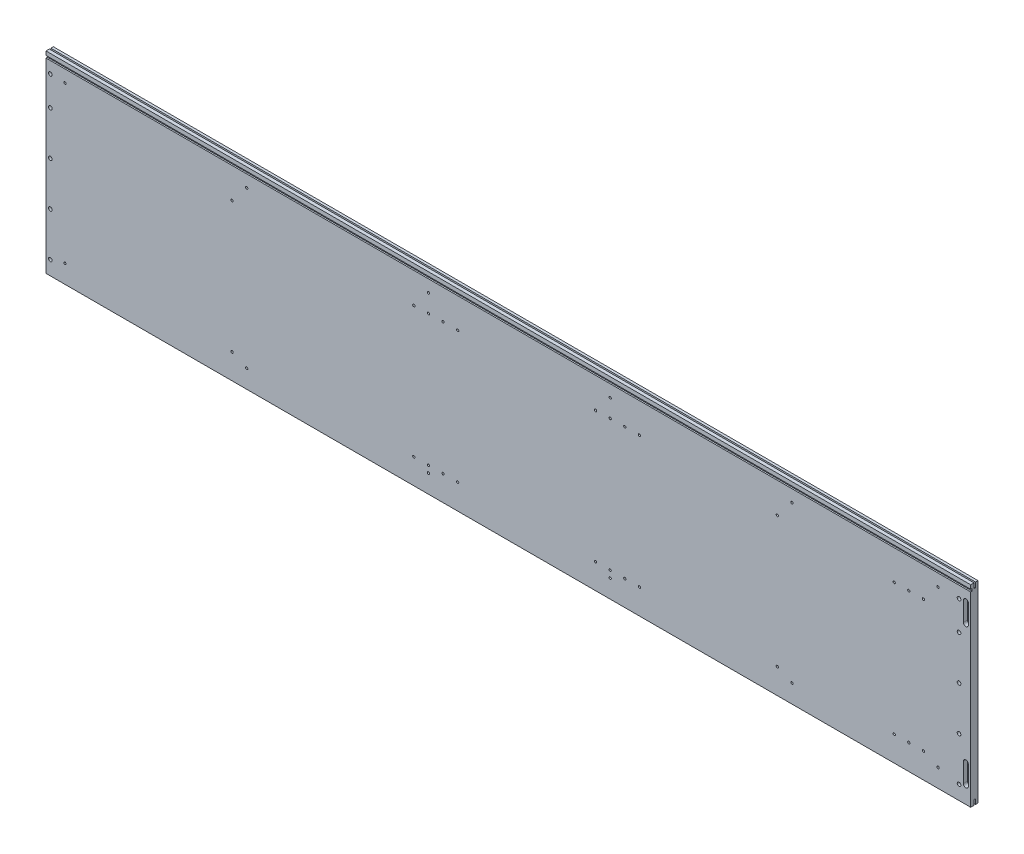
from build123d import *

# Parameters (mm, degrees)
SKIZZE1_W                                      = 2025
SKIZZE1_H                                      = 422
AUFSATZ_LINEAR_AUSTRAGEN1_DEPTH                = 16
F_8_0_8_DURCHMESSER_BOHRUNG1_D_BEL_D           = 8
F_8_0_8_DURCHMESSER_BOHRUNG1_D_BEL_DEPTH       = 11
F_8_0_8_DURCHMESSER_BOHRUNG1_D_BEL_TIP         = 2.403442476
SKIZZE4_W                                      = 3
SKIZZE4_H                                      = 5
SCHNITT_LINEAR_AUSTRAGEN1_RW_NUT_DEPTH         = 2037.026031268
SKIZZE7_W                                      = 3.2
SKIZZE7_H                                      = 11
SCHNITT_LINEAR_AUSTRAGEN3_ALU_PROFIL_NUT_DEPTH = 2037.026031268
SCHNITT_LINEAR_AUSTRAGEN4_H_HENVERSTELLE_DEPTH = 9
F_5_0_5_DURCHMESSER_BOHRUNG1_MITTELBODEN_D     = 5
F_5_0_5_DURCHMESSER_BOHRUNG1_MITTELBODEN_DEPTH = 12
F_5_0_5_DURCHMESSER_BOHRUNG1_MITTELBODEN_TIP   = 1.502151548
F_5_0_5_DURCHMESSER_BOHRUNG2_VERBINDER_D       = 5
SKIZZE15_W                                     = 8.365170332
SKIZZE15_H                                     = 3.2
SCHNITT_LINEAR_AUSTRAGEN1ALU_PROFIL_NUT_DEPTH  = 1093.855548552
F_5_0_5_DURCHMESSER_BOHRUNG1_D                 = 5
F_5_0_5_DURCHMESSER_BOHRUNG1_DEPTH             = 7
F_5_0_5_DURCHMESSER_BOHRUNG1_TIP               = 1.502151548


with BuildPart() as part:
    # Skizze1 → Aufsatz-Linear austragen1 (new body)
    with BuildSketch(Plane.XY):
        Rectangle(SKIZZE1_W, SKIZZE1_H)
    extrude(amount=AUFSATZ_LINEAR_AUSTRAGEN1_DEPTH)

    # 8.0 _8_ Durchmesser Bohrung1 D_bel
    with Locations(Plane.XY.offset(16)):
        with Locations((987, 172), (987, 108), (987, 12), (987, -84), (987, -180), (-1003, 172), (-1003, 108), (-1003, 12), (-1003, -84), (-1003, -180)):
            Hole(F_8_0_8_DURCHMESSER_BOHRUNG1_D_BEL_D / 2, depth=F_8_0_8_DURCHMESSER_BOHRUNG1_D_BEL_DEPTH)
            with Locations((0, 0, -(F_8_0_8_DURCHMESSER_BOHRUNG1_D_BEL_DEPTH + F_8_0_8_DURCHMESSER_BOHRUNG1_D_BEL_TIP / 2))):  # 118° drill point
                Cone(0, F_8_0_8_DURCHMESSER_BOHRUNG1_D_BEL_D / 2, F_8_0_8_DURCHMESSER_BOHRUNG1_D_BEL_TIP, mode=Mode.SUBTRACT)

    # Skizze4 → Schnitt-Linear austragen1 RW-Nut (cut, through all)
    with BuildSketch(Plane.ZY.offset(1012.5)):
        with Locations((14.5, 200)):
            Rectangle(SKIZZE4_W, SKIZZE4_H)
    extrude(amount=-SCHNITT_LINEAR_AUSTRAGEN1_RW_NUT_DEPTH, mode=Mode.SUBTRACT)

    # Skizze7 → Schnitt-Linear austragen3 Alu-Profil-Nut (cut, through all)
    with BuildSketch(Plane(origin=(1012.5, 0, 0), x_dir=(0, 0, -1), z_dir=(1, 0, 0))):
        with Locations((-7.1, 205.5)):
            Rectangle(SKIZZE7_W, SKIZZE7_H)
    schnitt_linear_austragen3_alu_profil_nut = extrude(amount=-SCHNITT_LINEAR_AUSTRAGEN3_ALU_PROFIL_NUT_DEPTH, mode=Mode.SUBTRACT)

    # Spiegeln1: Schnitt-Linear austragen3 Alu-Profil-Nut across plane
    add(schnitt_linear_austragen3_alu_profil_nut.mirror(Plane.ZX), mode=Mode.SUBTRACT)

    # Skizze9 → Schnitt-Linear austragen4 H_henverstelle (cut)
    with BuildSketch(Plane.XY.offset(16)):
        with BuildLine():
            Line((1007.3, 174), (1007.3, 131.8))
            ThreePointArc((1007.3, 131.8), (1001.9, 126.4), (996.5, 131.8))
            Line((996.5, 131.8), (996.5, 174))
            ThreePointArc((996.5, 174), (1001.9, 179.4), (1007.3, 174))
        make_face()
        with BuildLine():
            Line((1007.3, -131.8), (1007.3, -174))
            ThreePointArc((1007.3, -174), (1001.9, -179.4), (996.5, -174))
            Line((996.5, -174), (996.5, -131.8))
            ThreePointArc((996.5, -131.8), (1001.9, -126.4), (1007.3, -131.8))
        make_face()
    extrude(amount=-SCHNITT_LINEAR_AUSTRAGEN4_H_HENVERSTELLE_DEPTH, mode=Mode.SUBTRACT)

    # 5.0 _5_ Durchmesser Bohrung1 Mittelboden
    with Locations(Plane.XY.offset(16)):
        with Locations((589, 131), (191, 131), (-207, 131), (-207, -156), (191, -156), (589, -156), (-605, 131), (-605, -156)):
            Hole(F_5_0_5_DURCHMESSER_BOHRUNG1_MITTELBODEN_D / 2, depth=F_5_0_5_DURCHMESSER_BOHRUNG1_MITTELBODEN_DEPTH)
            with Locations((0, 0, -(F_5_0_5_DURCHMESSER_BOHRUNG1_MITTELBODEN_DEPTH + F_5_0_5_DURCHMESSER_BOHRUNG1_MITTELBODEN_TIP / 2))):  # 118° drill point
                Cone(0, F_5_0_5_DURCHMESSER_BOHRUNG1_MITTELBODEN_D / 2, F_5_0_5_DURCHMESSER_BOHRUNG1_MITTELBODEN_TIP, mode=Mode.SUBTRACT)

    # 5.0 _5_ Durchmesser Bohrung2 Verbinder (through all)
    with Locations(Plane.XY.offset(16)):
        with Locations((941, 171), (621, 171), (223, 171), (-175, 171), (-573, 171), (-971, 171), (-971, -171), (-573, -171), (-175, -171), (223, -171), (621, -171), (941, -171)):
            Hole(F_5_0_5_DURCHMESSER_BOHRUNG2_VERBINDER_D / 2)

    # Skizze15 → Schnitt-Linear austragen1Alu-Profil-Nut (cut, through all)
    with BuildSketch(Plane.XZ.offset(200)):
        with Locations((-1008.317414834, 7.1)):
            Rectangle(SKIZZE15_W, SKIZZE15_H)
    extrude(amount=-SCHNITT_LINEAR_AUSTRAGEN1ALU_PROFIL_NUT_DEPTH, mode=Mode.SUBTRACT)

    # 5.0 _5_ Durchmesser Bohrung1
    with Locations(Plane.XY.offset(16)):
        with Locations((909, 132), (877, 132), (845, 132), (845, -156), (877, -156), (909, -156), (-175, 132), (-143, 132), (-111, 132), (-111, -156), (-143, -156), (-175, -156), (223, 132), (255, 132), (287, 132), (287, -156), (255, -156), (223, -156)):
            Hole(F_5_0_5_DURCHMESSER_BOHRUNG1_D / 2, depth=F_5_0_5_DURCHMESSER_BOHRUNG1_DEPTH)
            with Locations((0, 0, -(F_5_0_5_DURCHMESSER_BOHRUNG1_DEPTH + F_5_0_5_DURCHMESSER_BOHRUNG1_TIP / 2))):  # 118° drill point
                Cone(0, F_5_0_5_DURCHMESSER_BOHRUNG1_D / 2, F_5_0_5_DURCHMESSER_BOHRUNG1_TIP, mode=Mode.SUBTRACT)


solid = part.part
